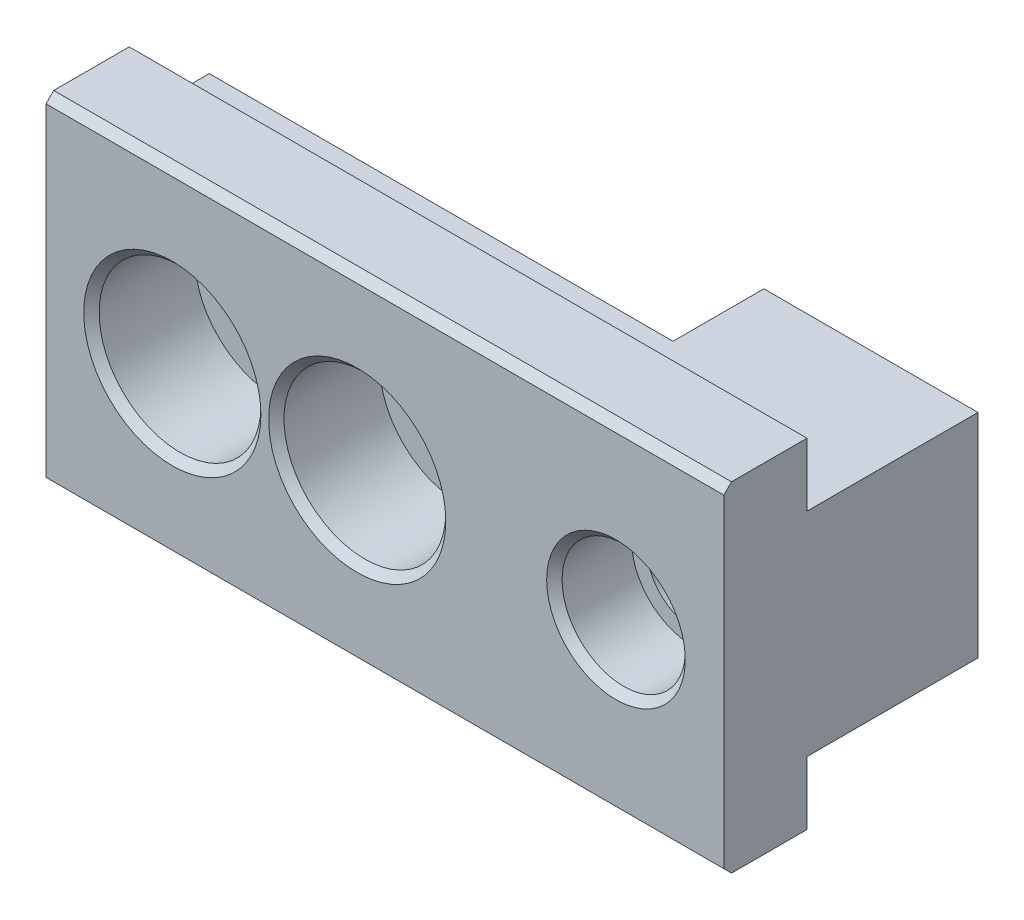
ISO-10303-21;
HEADER;
FILE_DESCRIPTION(('STEP AP214'),'2;1');
FILE_NAME('part.step','',(''),(''),'','','');
FILE_SCHEMA(('AUTOMOTIVE_DESIGN { 1 0 10303 214 1 1 1 1 }'));
ENDSEC;
DATA;
#1=APPLICATION_CONTEXT('core data for automotive mechanical design processes');
#2=APPLICATION_PROTOCOL_DEFINITION('international standard','automotive_design',2000,#1);
#3=PRODUCT_CONTEXT('',#1,'mechanical');
#4=PRODUCT('Part','Part','',(#3));
#5=PRODUCT_RELATED_PRODUCT_CATEGORY('part','',(#4));
#6=PRODUCT_DEFINITION_FORMATION('','',#4);
#7=PRODUCT_DEFINITION_CONTEXT('part definition',#1,'design');
#8=PRODUCT_DEFINITION('design','',#6,#7);
#9=PRODUCT_DEFINITION_SHAPE('','',#8);
#10=(LENGTH_UNIT() NAMED_UNIT(*) SI_UNIT(.MILLI.,.METRE.));
#11=(NAMED_UNIT(*) PLANE_ANGLE_UNIT() SI_UNIT($,.RADIAN.));
#12=(NAMED_UNIT(*) SI_UNIT($,.STERADIAN.) SOLID_ANGLE_UNIT());
#13=UNCERTAINTY_MEASURE_WITH_UNIT(LENGTH_MEASURE(1.E-05),#10,'distance_accuracy_value','');
#14=(GEOMETRIC_REPRESENTATION_CONTEXT(3) GLOBAL_UNCERTAINTY_ASSIGNED_CONTEXT((#13)) GLOBAL_UNIT_ASSIGNED_CONTEXT((#10,
#11,#12)) REPRESENTATION_CONTEXT('',''));
#15=CARTESIAN_POINT('',(0.,0.,0.));
#16=DIRECTION('',(0.,0.,1.));
#17=DIRECTION('',(1.,0.,0.));
#18=AXIS2_PLACEMENT_3D('',#15,#16,#17);
#19=CARTESIAN_POINT('',(-28.8,0.,5.4000000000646));
#20=DIRECTION('',(0.,0.,-1.));
#21=DIRECTION('',(0.,-1.,0.));
#22=AXIS2_PLACEMENT_3D('',#19,#20,#21);
#23=CYLINDRICAL_SURFACE('',#22,3.1);
#24=CARTESIAN_POINT('',(-28.8,0.,-4.7));
#25=DIRECTION('',(0.,0.,1.));
#26=DIRECTION('',(0.,1.,0.));
#27=AXIS2_PLACEMENT_3D('',#24,#25,#26);
#28=CIRCLE('',#27,3.1);
#29=CARTESIAN_POINT('',(-28.8,3.1,-4.70000000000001));
#30=VERTEX_POINT('',#29);
#31=EDGE_CURVE('E184',#30,#30,#28,.F.);
#32=ORIENTED_EDGE('',*,*,#31,.T.);
#33=EDGE_LOOP('',(#32));
#34=FACE_BOUND('',#33,.T.);
#35=CARTESIAN_POINT('',(-28.8,0.,-1.3));
#36=DIRECTION('',(0.,0.,1.));
#37=DIRECTION('',(1.,0.,0.));
#38=AXIS2_PLACEMENT_3D('',#35,#36,#37);
#39=CIRCLE('',#38,3.1);
#40=CARTESIAN_POINT('',(-25.7,0.,-1.3));
#41=VERTEX_POINT('',#40);
#42=EDGE_CURVE('E18',#41,#41,#39,.F.);
#43=ORIENTED_EDGE('',*,*,#42,.F.);
#44=EDGE_LOOP('',(#43));
#45=FACE_BOUND('',#44,.T.);
#46=ADVANCED_FACE('F14',(#34,#45),#23,.F.);
#47=CARTESIAN_POINT('',(-16.8,0.,5.4000000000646));
#48=DIRECTION('',(0.,0.,-1.));
#49=DIRECTION('',(0.,-1.,0.));
#50=AXIS2_PLACEMENT_3D('',#47,#48,#49);
#51=CYLINDRICAL_SURFACE('',#50,3.1);
#52=CARTESIAN_POINT('',(-16.8,0.,-4.7));
#53=DIRECTION('',(0.,0.,1.));
#54=DIRECTION('',(0.,1.,0.));
#55=AXIS2_PLACEMENT_3D('',#52,#53,#54);
#56=CIRCLE('',#55,3.1);
#57=CARTESIAN_POINT('',(-16.8,3.1,-4.70000000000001));
#58=VERTEX_POINT('',#57);
#59=EDGE_CURVE('E175',#58,#58,#56,.F.);
#60=ORIENTED_EDGE('',*,*,#59,.T.);
#61=EDGE_LOOP('',(#60));
#62=FACE_BOUND('',#61,.T.);
#63=CARTESIAN_POINT('',(-16.8,0.,-1.3));
#64=DIRECTION('',(0.,0.,1.));
#65=DIRECTION('',(1.,0.,0.));
#66=AXIS2_PLACEMENT_3D('',#63,#64,#65);
#67=CIRCLE('',#66,3.1);
#68=CARTESIAN_POINT('',(-13.7,0.,-1.3));
#69=VERTEX_POINT('',#68);
#70=EDGE_CURVE('E112',#69,#69,#67,.F.);
#71=ORIENTED_EDGE('',*,*,#70,.F.);
#72=EDGE_LOOP('',(#71));
#73=FACE_BOUND('',#72,.T.);
#74=ADVANCED_FACE('F284',(#62,#73),#51,.F.);
#75=CARTESIAN_POINT('',(0.,0.,0.4));
#76=DIRECTION('',(0.,0.,1.));
#77=DIRECTION('',(-1.,0.,0.));
#78=AXIS2_PLACEMENT_3D('',#75,#76,#77);
#79=PLANE('',#78);
#80=CARTESIAN_POINT('',(0.,0.,0.4));
#81=DIRECTION('',(0.,0.,1.));
#82=DIRECTION('',(-1.,0.,0.));
#83=AXIS2_PLACEMENT_3D('',#80,#81,#82);
#84=CIRCLE('',#83,3.);
#85=CARTESIAN_POINT('',(-3.,0.,0.4));
#86=VERTEX_POINT('',#85);
#87=EDGE_CURVE('E164',#86,#86,#84,.T.);
#88=ORIENTED_EDGE('',*,*,#87,.F.);
#89=EDGE_LOOP('',(#88));
#90=FACE_BOUND('',#89,.T.);
#91=CARTESIAN_POINT('',(0.,0.,0.4));
#92=DIRECTION('',(0.,0.,1.));
#93=DIRECTION('',(-1.,0.,0.));
#94=AXIS2_PLACEMENT_3D('',#91,#92,#93);
#95=CIRCLE('',#94,4.);
#96=CARTESIAN_POINT('',(-4.,0.,0.4));
#97=VERTEX_POINT('',#96);
#98=EDGE_CURVE('E154',#97,#97,#95,.T.);
#99=ORIENTED_EDGE('',*,*,#98,.T.);
#100=EDGE_LOOP('',(#99));
#101=FACE_BOUND('',#100,.T.);
#102=ADVANCED_FACE('F291',(#90,#101),#79,.T.);
#103=CARTESIAN_POINT('',(0.,0.,0.4));
#104=DIRECTION('',(0.,0.,1.));
#105=DIRECTION('',(-1.,0.,0.));
#106=AXIS2_PLACEMENT_3D('',#103,#104,#105);
#107=CYLINDRICAL_SURFACE('',#106,4.);
#108=CARTESIAN_POINT('',(0.,0.,4.90000000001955));
#109=DIRECTION('',(0.,0.,1.));
#110=DIRECTION('',(-1.,0.,0.));
#111=AXIS2_PLACEMENT_3D('',#108,#109,#110);
#112=CIRCLE('',#111,3.99999999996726);
#113=CARTESIAN_POINT('',(-3.99999999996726,0.,4.90000000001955));
#114=VERTEX_POINT('',#113);
#115=EDGE_CURVE('E140',#114,#114,#112,.T.);
#116=ORIENTED_EDGE('',*,*,#115,.T.);
#117=EDGE_LOOP('',(#116));
#118=FACE_BOUND('',#117,.T.);
#119=ORIENTED_EDGE('',*,*,#98,.F.);
#120=EDGE_LOOP('',(#119));
#121=FACE_BOUND('',#120,.T.);
#122=ADVANCED_FACE('F487',(#118,#121),#107,.F.);
#123=CARTESIAN_POINT('',(-7.,6.9,-11.1));
#124=DIRECTION('',(0.,0.,1.));
#125=DIRECTION('',(-1.,0.,0.));
#126=AXIS2_PLACEMENT_3D('',#123,#124,#125);
#127=PLANE('',#126);
#128=CARTESIAN_POINT('',(0.,0.,-11.1));
#129=DIRECTION('',(0.,0.,1.));
#130=DIRECTION('',(-1.,0.,0.));
#131=AXIS2_PLACEMENT_3D('',#128,#129,#130);
#132=CIRCLE('',#131,3.5);
#133=CARTESIAN_POINT('',(-3.5,0.,-11.1));
#134=VERTEX_POINT('',#133);
#135=EDGE_CURVE('E165',#134,#134,#132,.T.);
#136=ORIENTED_EDGE('',*,*,#135,.T.);
#137=EDGE_LOOP('',(#136));
#138=FACE_BOUND('',#137,.T.);
#139=DIRECTION('',(-1.,0.,0.));
#140=VECTOR('',#139,1.);
#141=CARTESIAN_POINT('',(-7.,-6.9,-11.1));
#142=LINE('',#141,#140);
#143=CARTESIAN_POINT('',(7.,-6.9,-11.1));
#144=VERTEX_POINT('',#143);
#145=CARTESIAN_POINT('',(-6.9,-6.9,-11.1));
#146=VERTEX_POINT('',#145);
#147=EDGE_CURVE('E145',#144,#146,#142,.T.);
#148=ORIENTED_EDGE('',*,*,#147,.T.);
#149=DIRECTION('',(0.,-1.,0.));
#150=VECTOR('',#149,1.);
#151=CARTESIAN_POINT('',(-6.9,16.5302528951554,-11.1));
#152=LINE('',#151,#150);
#153=CARTESIAN_POINT('',(-6.9,6.9,-11.1));
#154=VERTEX_POINT('',#153);
#155=EDGE_CURVE('E231',#154,#146,#152,.T.);
#156=ORIENTED_EDGE('',*,*,#155,.F.);
#157=DIRECTION('',(1.,0.,0.));
#158=VECTOR('',#157,1.);
#159=CARTESIAN_POINT('',(-7.,6.9,-11.1));
#160=LINE('',#159,#158);
#161=CARTESIAN_POINT('',(7.,6.9,-11.1));
#162=VERTEX_POINT('',#161);
#163=EDGE_CURVE('E150',#154,#162,#160,.T.);
#164=ORIENTED_EDGE('',*,*,#163,.T.);
#165=DIRECTION('',(0.,1.,0.));
#166=VECTOR('',#165,1.);
#167=CARTESIAN_POINT('',(7.,6.9,-11.1));
#168=LINE('',#167,#166);
#169=EDGE_CURVE('E130',#144,#162,#168,.T.);
#170=ORIENTED_EDGE('',*,*,#169,.F.);
#171=EDGE_LOOP('',(#148,#156,#164,#170));
#172=FACE_BOUND('',#171,.T.);
#173=ADVANCED_FACE('F269',(#138,#172),#127,.F.);
#174=CARTESIAN_POINT('',(-7.,12.3,0.));
#175=DIRECTION('',(0.,0.,1.));
#176=DIRECTION('',(-1.,0.,0.));
#177=AXIS2_PLACEMENT_3D('',#174,#175,#176);
#178=PLANE('',#177);
#179=DIRECTION('',(0.,-1.,0.));
#180=VECTOR('',#179,1.);
#181=CARTESIAN_POINT('',(-37.,6.9,0.));
#182=LINE('',#181,#180);
#183=CARTESIAN_POINT('',(-37.,11.,0.));
#184=VERTEX_POINT('',#183);
#185=CARTESIAN_POINT('',(-37.,6.9,0.));
#186=VERTEX_POINT('',#185);
#187=EDGE_CURVE('E119',#184,#186,#182,.T.);
#188=ORIENTED_EDGE('',*,*,#187,.F.);
#189=DIRECTION('',(1.,0.,0.));
#190=VECTOR('',#189,1.);
#191=CARTESIAN_POINT('',(-7.,11.,0.));
#192=LINE('',#191,#190);
#193=CARTESIAN_POINT('',(7.,11.,0.));
#194=VERTEX_POINT('',#193);
#195=EDGE_CURVE('E107',#184,#194,#192,.T.);
#196=ORIENTED_EDGE('',*,*,#195,.T.);
#197=DIRECTION('',(0.,1.,0.));
#198=VECTOR('',#197,1.);
#199=CARTESIAN_POINT('',(7.,6.9,0.));
#200=LINE('',#199,#198);
#201=CARTESIAN_POINT('',(7.,6.9,0.));
#202=VERTEX_POINT('',#201);
#203=EDGE_CURVE('E118',#202,#194,#200,.T.);
#204=ORIENTED_EDGE('',*,*,#203,.F.);
#205=DIRECTION('',(1.,0.,0.));
#206=VECTOR('',#205,1.);
#207=CARTESIAN_POINT('',(-7.,6.9,0.));
#208=LINE('',#207,#206);
#209=EDGE_CURVE('E152',#202,#186,#208,.F.);
#210=ORIENTED_EDGE('',*,*,#209,.T.);
#211=EDGE_LOOP('',(#188,#196,#204,#210));
#212=FACE_BOUND('',#211,.T.);
#213=ADVANCED_FACE('F116',(#212),#178,.F.);
#214=CARTESIAN_POINT('',(-7.,6.9,-11.1));
#215=DIRECTION('',(0.,-1.,0.));
#216=DIRECTION('',(1.,0.,0.));
#217=AXIS2_PLACEMENT_3D('',#214,#215,#216);
#218=PLANE('',#217);
#219=DIRECTION('',(0.,0.,1.));
#220=VECTOR('',#219,1.);
#221=CARTESIAN_POINT('',(-6.9,6.9,-11.1));
#222=LINE('',#221,#220);
#223=CARTESIAN_POINT('',(-6.9,6.9,-5.2));
#224=VERTEX_POINT('',#223);
#225=EDGE_CURVE('E236',#154,#224,#222,.T.);
#226=ORIENTED_EDGE('',*,*,#225,.T.);
#227=DIRECTION('',(-1.,0.,0.));
#228=VECTOR('',#227,1.);
#229=CARTESIAN_POINT('',(-37.,6.9,-5.2));
#230=LINE('',#229,#228);
#231=CARTESIAN_POINT('',(-37.,6.9,-5.2));
#232=VERTEX_POINT('',#231);
#233=EDGE_CURVE('E148',#224,#232,#230,.T.);
#234=ORIENTED_EDGE('',*,*,#233,.T.);
#235=DIRECTION('',(0.,0.,1.));
#236=VECTOR('',#235,1.);
#237=CARTESIAN_POINT('',(-37.,6.9,-11.1));
#238=LINE('',#237,#236);
#239=EDGE_CURVE('E128',#186,#232,#238,.F.);
#240=ORIENTED_EDGE('',*,*,#239,.F.);
#241=ORIENTED_EDGE('',*,*,#209,.F.);
#242=DIRECTION('',(0.,0.,1.));
#243=VECTOR('',#242,1.);
#244=CARTESIAN_POINT('',(7.,6.9,-11.1));
#245=LINE('',#244,#243);
#246=EDGE_CURVE('E126',#162,#202,#245,.T.);
#247=ORIENTED_EDGE('',*,*,#246,.F.);
#248=ORIENTED_EDGE('',*,*,#163,.F.);
#249=EDGE_LOOP('',(#226,#234,#240,#241,#247,#248));
#250=FACE_BOUND('',#249,.T.);
#251=ADVANCED_FACE('F271',(#250),#218,.F.);
#252=CARTESIAN_POINT('',(-37.,-6.9,-5.2));
#253=DIRECTION('',(0.,0.,1.));
#254=DIRECTION('',(0.,1.,0.));
#255=AXIS2_PLACEMENT_3D('',#252,#253,#254);
#256=PLANE('',#255);
#257=CARTESIAN_POINT('',(-16.8,0.,-5.2));
#258=DIRECTION('',(0.,0.,1.));
#259=DIRECTION('',(0.,1.,0.));
#260=AXIS2_PLACEMENT_3D('',#257,#258,#259);
#261=CIRCLE('',#260,3.6);
#262=CARTESIAN_POINT('',(-16.8,3.6,-5.2));
#263=VERTEX_POINT('',#262);
#264=EDGE_CURVE('E181',#263,#263,#261,.T.);
#265=ORIENTED_EDGE('',*,*,#264,.T.);
#266=EDGE_LOOP('',(#265));
#267=FACE_BOUND('',#266,.T.);
#268=CARTESIAN_POINT('',(-28.8,0.,-5.2));
#269=DIRECTION('',(0.,0.,1.));
#270=DIRECTION('',(0.,1.,0.));
#271=AXIS2_PLACEMENT_3D('',#268,#269,#270);
#272=CIRCLE('',#271,3.6);
#273=CARTESIAN_POINT('',(-28.8,3.6,-5.2));
#274=VERTEX_POINT('',#273);
#275=EDGE_CURVE('E178',#274,#274,#272,.T.);
#276=ORIENTED_EDGE('',*,*,#275,.T.);
#277=EDGE_LOOP('',(#276));
#278=FACE_BOUND('',#277,.T.);
#279=DIRECTION('',(0.,-1.,0.));
#280=VECTOR('',#279,1.);
#281=CARTESIAN_POINT('',(-37.,6.9,-5.2));
#282=LINE('',#281,#280);
#283=CARTESIAN_POINT('',(-37.,-6.9,-5.2));
#284=VERTEX_POINT('',#283);
#285=EDGE_CURVE('E249',#232,#284,#282,.T.);
#286=ORIENTED_EDGE('',*,*,#285,.F.);
#287=ORIENTED_EDGE('',*,*,#233,.F.);
#288=DIRECTION('',(0.,-1.,0.));
#289=VECTOR('',#288,1.);
#290=CARTESIAN_POINT('',(-6.9,16.5302528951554,-5.2));
#291=LINE('',#290,#289);
#292=CARTESIAN_POINT('',(-6.9,-6.9,-5.2));
#293=VERTEX_POINT('',#292);
#294=EDGE_CURVE('E233',#224,#293,#291,.T.);
#295=ORIENTED_EDGE('',*,*,#294,.T.);
#296=DIRECTION('',(-1.,0.,0.));
#297=VECTOR('',#296,1.);
#298=CARTESIAN_POINT('',(-7.,-6.9,-5.2));
#299=LINE('',#298,#297);
#300=EDGE_CURVE('E143',#293,#284,#299,.T.);
#301=ORIENTED_EDGE('',*,*,#300,.T.);
#302=EDGE_LOOP('',(#286,#287,#295,#301));
#303=FACE_BOUND('',#302,.T.);
#304=ADVANCED_FACE('F259',(#267,#278,#303),#256,.F.);
#305=CARTESIAN_POINT('',(-7.,-6.9,-11.1));
#306=DIRECTION('',(0.,1.,0.));
#307=DIRECTION('',(-1.,0.,0.));
#308=AXIS2_PLACEMENT_3D('',#305,#306,#307);
#309=PLANE('',#308);
#310=ORIENTED_EDGE('',*,*,#300,.F.);
#311=DIRECTION('',(0.,0.,-1.));
#312=VECTOR('',#311,1.);
#313=CARTESIAN_POINT('',(-6.9,-6.9,-11.1));
#314=LINE('',#313,#312);
#315=EDGE_CURVE('E172',#293,#146,#314,.T.);
#316=ORIENTED_EDGE('',*,*,#315,.T.);
#317=ORIENTED_EDGE('',*,*,#147,.F.);
#318=DIRECTION('',(0.,0.,1.));
#319=VECTOR('',#318,1.);
#320=CARTESIAN_POINT('',(7.,-6.9,-11.1));
#321=LINE('',#320,#319);
#322=CARTESIAN_POINT('',(7.,-6.9,0.));
#323=VERTEX_POINT('',#322);
#324=EDGE_CURVE('E135',#323,#144,#321,.F.);
#325=ORIENTED_EDGE('',*,*,#324,.F.);
#326=DIRECTION('',(-1.,0.,0.));
#327=VECTOR('',#326,1.);
#328=CARTESIAN_POINT('',(-7.,-6.9,0.));
#329=LINE('',#328,#327);
#330=CARTESIAN_POINT('',(-37.,-6.9,0.));
#331=VERTEX_POINT('',#330);
#332=EDGE_CURVE('E141',#323,#331,#329,.T.);
#333=ORIENTED_EDGE('',*,*,#332,.T.);
#334=DIRECTION('',(0.,0.,1.));
#335=VECTOR('',#334,1.);
#336=CARTESIAN_POINT('',(-37.,-6.9,-11.1));
#337=LINE('',#336,#335);
#338=EDGE_CURVE('E246',#284,#331,#337,.T.);
#339=ORIENTED_EDGE('',*,*,#338,.F.);
#340=EDGE_LOOP('',(#310,#316,#317,#325,#333,#339));
#341=FACE_BOUND('',#340,.T.);
#342=ADVANCED_FACE('F263',(#341),#309,.F.);
#343=CARTESIAN_POINT('',(-7.,-6.9,0.));
#344=DIRECTION('',(0.,0.,1.));
#345=DIRECTION('',(-1.,0.,0.));
#346=AXIS2_PLACEMENT_3D('',#343,#344,#345);
#347=PLANE('',#346);
#348=DIRECTION('',(0.,1.,0.));
#349=VECTOR('',#348,1.);
#350=CARTESIAN_POINT('',(7.,6.9,0.));
#351=LINE('',#350,#349);
#352=CARTESIAN_POINT('',(7.,-11.,0.));
#353=VERTEX_POINT('',#352);
#354=EDGE_CURVE('E138',#353,#323,#351,.T.);
#355=ORIENTED_EDGE('',*,*,#354,.F.);
#356=DIRECTION('',(-1.,0.,0.));
#357=VECTOR('',#356,1.);
#358=CARTESIAN_POINT('',(-7.,-11.,0.));
#359=LINE('',#358,#357);
#360=CARTESIAN_POINT('',(-37.,-11.,0.));
#361=VERTEX_POINT('',#360);
#362=EDGE_CURVE('E227',#353,#361,#359,.T.);
#363=ORIENTED_EDGE('',*,*,#362,.T.);
#364=DIRECTION('',(0.,-1.,0.));
#365=VECTOR('',#364,1.);
#366=CARTESIAN_POINT('',(-37.,6.9,0.));
#367=LINE('',#366,#365);
#368=EDGE_CURVE('E161',#331,#361,#367,.T.);
#369=ORIENTED_EDGE('',*,*,#368,.F.);
#370=ORIENTED_EDGE('',*,*,#332,.F.);
#371=EDGE_LOOP('',(#355,#363,#369,#370));
#372=FACE_BOUND('',#371,.T.);
#373=ADVANCED_FACE('F316',(#372),#347,.F.);
#374=CARTESIAN_POINT('',(0.,0.,5.4000000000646));
#375=DIRECTION('',(0.,0.,1.));
#376=DIRECTION('',(-1.,0.,0.));
#377=AXIS2_PLACEMENT_3D('',#374,#375,#376);
#378=CONICAL_SURFACE('',#377,4.49999999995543,0.785398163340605);
#379=CARTESIAN_POINT('',(0.,0.,5.4000000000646));
#380=DIRECTION('',(0.,0.,1.));
#381=DIRECTION('',(-1.,0.,0.));
#382=AXIS2_PLACEMENT_3D('',#379,#380,#381);
#383=CIRCLE('',#382,4.49999999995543);
#384=CARTESIAN_POINT('',(-4.49999999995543,0.,5.4000000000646));
#385=VERTEX_POINT('',#384);
#386=EDGE_CURVE('E157',#385,#385,#383,.T.);
#387=ORIENTED_EDGE('',*,*,#386,.T.);
#388=EDGE_LOOP('',(#387));
#389=FACE_BOUND('',#388,.T.);
#390=ORIENTED_EDGE('',*,*,#115,.F.);
#391=EDGE_LOOP('',(#390));
#392=FACE_BOUND('',#391,.T.);
#393=ADVANCED_FACE('F313',(#389,#392),#378,.F.);
#394=CARTESIAN_POINT('',(7.,6.9,-11.1));
#395=DIRECTION('',(1.,0.,0.));
#396=DIRECTION('',(0.,1.,0.));
#397=AXIS2_PLACEMENT_3D('',#394,#395,#396);
#398=PLANE('',#397);
#399=DIRECTION('',(0.,0.,-1.));
#400=VECTOR('',#399,1.);
#401=CARTESIAN_POINT('',(7.,11.,6.51132535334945));
#402=LINE('',#401,#400);
#403=CARTESIAN_POINT('',(7.,11.,4.9));
#404=VERTEX_POINT('',#403);
#405=EDGE_CURVE('E104',#404,#194,#402,.T.);
#406=ORIENTED_EDGE('',*,*,#405,.F.);
#407=DIRECTION('',(0.,0.707106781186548,-0.707106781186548));
#408=VECTOR('',#407,1.);
#409=CARTESIAN_POINT('',(7.,16.95,-1.05));
#410=LINE('',#409,#408);
#411=CARTESIAN_POINT('',(7.,10.5,5.4));
#412=VERTEX_POINT('',#411);
#413=EDGE_CURVE('E23',#404,#412,#410,.F.);
#414=ORIENTED_EDGE('',*,*,#413,.T.);
#415=DIRECTION('',(0.,-1.,0.));
#416=VECTOR('',#415,1.);
#417=CARTESIAN_POINT('',(7.,12.3,5.4));
#418=LINE('',#417,#416);
#419=CARTESIAN_POINT('',(7.,-10.5,5.4));
#420=VERTEX_POINT('',#419);
#421=EDGE_CURVE('E160',#412,#420,#418,.T.);
#422=ORIENTED_EDGE('',*,*,#421,.T.);
#423=DIRECTION('',(0.,0.707106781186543,0.707106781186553));
#424=VECTOR('',#423,1.);
#425=CARTESIAN_POINT('',(7.,-10.0500000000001,5.84999999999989));
#426=LINE('',#425,#424);
#427=CARTESIAN_POINT('',(7.,-11.,4.9));
#428=VERTEX_POINT('',#427);
#429=EDGE_CURVE('E31',#420,#428,#426,.F.);
#430=ORIENTED_EDGE('',*,*,#429,.T.);
#431=DIRECTION('',(0.,0.,1.));
#432=VECTOR('',#431,1.);
#433=CARTESIAN_POINT('',(7.,-11.,6.51132535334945));
#434=LINE('',#433,#432);
#435=EDGE_CURVE('E120',#353,#428,#434,.T.);
#436=ORIENTED_EDGE('',*,*,#435,.F.);
#437=ORIENTED_EDGE('',*,*,#354,.T.);
#438=ORIENTED_EDGE('',*,*,#324,.T.);
#439=ORIENTED_EDGE('',*,*,#169,.T.);
#440=ORIENTED_EDGE('',*,*,#246,.T.);
#441=ORIENTED_EDGE('',*,*,#203,.T.);
#442=EDGE_LOOP('',(#406,#414,#422,#430,#436,#437,#438,#439,#440,#441));
#443=FACE_BOUND('',#442,.T.);
#444=ADVANCED_FACE('F123',(#443),#398,.T.);
#445=CARTESIAN_POINT('',(-37.,6.9,-11.1));
#446=DIRECTION('',(-1.,0.,0.));
#447=DIRECTION('',(0.,-1.,0.));
#448=AXIS2_PLACEMENT_3D('',#445,#446,#447);
#449=PLANE('',#448);
#450=DIRECTION('',(0.,-1.,0.));
#451=VECTOR('',#450,1.);
#452=CARTESIAN_POINT('',(-37.,12.3,5.4));
#453=LINE('',#452,#451);
#454=CARTESIAN_POINT('',(-37.,-10.5,5.4));
#455=VERTEX_POINT('',#454);
#456=CARTESIAN_POINT('',(-37.,10.5,5.4));
#457=VERTEX_POINT('',#456);
#458=EDGE_CURVE('E169',#455,#457,#453,.F.);
#459=ORIENTED_EDGE('',*,*,#458,.T.);
#460=DIRECTION('',(0.,-0.707106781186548,0.707106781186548));
#461=VECTOR('',#460,1.);
#462=CARTESIAN_POINT('',(-37.,16.95,-1.05));
#463=LINE('',#462,#461);
#464=CARTESIAN_POINT('',(-37.,11.,4.9));
#465=VERTEX_POINT('',#464);
#466=EDGE_CURVE('E207',#457,#465,#463,.F.);
#467=ORIENTED_EDGE('',*,*,#466,.T.);
#468=DIRECTION('',(0.,0.,-1.));
#469=VECTOR('',#468,1.);
#470=CARTESIAN_POINT('',(-37.,11.,6.51132535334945));
#471=LINE('',#470,#469);
#472=EDGE_CURVE('E111',#465,#184,#471,.T.);
#473=ORIENTED_EDGE('',*,*,#472,.T.);
#474=ORIENTED_EDGE('',*,*,#187,.T.);
#475=ORIENTED_EDGE('',*,*,#239,.T.);
#476=ORIENTED_EDGE('',*,*,#285,.T.);
#477=ORIENTED_EDGE('',*,*,#338,.T.);
#478=ORIENTED_EDGE('',*,*,#368,.T.);
#479=DIRECTION('',(0.,0.,1.));
#480=VECTOR('',#479,1.);
#481=CARTESIAN_POINT('',(-37.,-11.,6.51132535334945));
#482=LINE('',#481,#480);
#483=CARTESIAN_POINT('',(-37.,-11.,4.9));
#484=VERTEX_POINT('',#483);
#485=EDGE_CURVE('E224',#361,#484,#482,.T.);
#486=ORIENTED_EDGE('',*,*,#485,.T.);
#487=DIRECTION('',(0.,-0.707106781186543,-0.707106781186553));
#488=VECTOR('',#487,1.);
#489=CARTESIAN_POINT('',(-37.,-10.0500000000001,5.84999999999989));
#490=LINE('',#489,#488);
#491=EDGE_CURVE('E205',#484,#455,#490,.F.);
#492=ORIENTED_EDGE('',*,*,#491,.T.);
#493=EDGE_LOOP('',(#459,#467,#473,#474,#475,#476,#477,#478,#486,#492));
#494=FACE_BOUND('',#493,.T.);
#495=ADVANCED_FACE('F255',(#494),#449,.T.);
#496=CARTESIAN_POINT('',(-7.,12.3,5.4));
#497=DIRECTION('',(0.,0.,-1.));
#498=DIRECTION('',(1.,0.,0.));
#499=AXIS2_PLACEMENT_3D('',#496,#497,#498);
#500=PLANE('',#499);
#501=CARTESIAN_POINT('',(-16.8,0.,5.4));
#502=DIRECTION('',(0.,0.,-1.));
#503=DIRECTION('',(1.,0.,0.));
#504=AXIS2_PLACEMENT_3D('',#501,#502,#503);
#505=CIRCLE('',#504,5.75);
#506=CARTESIAN_POINT('',(-11.05,0.,5.4));
#507=VERTEX_POINT('',#506);
#508=EDGE_CURVE('E193',#507,#507,#505,.T.);
#509=ORIENTED_EDGE('',*,*,#508,.T.);
#510=EDGE_LOOP('',(#509));
#511=FACE_BOUND('',#510,.T.);
#512=CARTESIAN_POINT('',(-28.8,0.,5.4));
#513=DIRECTION('',(0.,0.,-1.));
#514=DIRECTION('',(1.,0.,0.));
#515=AXIS2_PLACEMENT_3D('',#512,#513,#514);
#516=CIRCLE('',#515,5.75);
#517=CARTESIAN_POINT('',(-23.05,0.,5.4));
#518=VERTEX_POINT('',#517);
#519=EDGE_CURVE('E190',#518,#518,#516,.T.);
#520=ORIENTED_EDGE('',*,*,#519,.T.);
#521=EDGE_LOOP('',(#520));
#522=FACE_BOUND('',#521,.T.);
#523=ORIENTED_EDGE('',*,*,#421,.F.);
#524=DIRECTION('',(-1.,0.,0.));
#525=VECTOR('',#524,1.);
#526=CARTESIAN_POINT('',(-7.,10.5,5.4));
#527=LINE('',#526,#525);
#528=EDGE_CURVE('E202',#412,#457,#527,.T.);
#529=ORIENTED_EDGE('',*,*,#528,.T.);
#530=ORIENTED_EDGE('',*,*,#458,.F.);
#531=DIRECTION('',(1.,0.,0.));
#532=VECTOR('',#531,1.);
#533=CARTESIAN_POINT('',(-7.,-10.5,5.4));
#534=LINE('',#533,#532);
#535=EDGE_CURVE('E199',#455,#420,#534,.T.);
#536=ORIENTED_EDGE('',*,*,#535,.T.);
#537=EDGE_LOOP('',(#523,#529,#530,#536));
#538=FACE_BOUND('',#537,.T.);
#539=ORIENTED_EDGE('',*,*,#386,.F.);
#540=EDGE_LOOP('',(#539));
#541=FACE_BOUND('',#540,.T.);
#542=ADVANCED_FACE('F294',(#511,#522,#538,#541),#500,.F.);
#543=CARTESIAN_POINT('',(0.,0.,-11.1));
#544=DIRECTION('',(0.,0.,1.));
#545=DIRECTION('',(-1.,0.,0.));
#546=AXIS2_PLACEMENT_3D('',#543,#544,#545);
#547=CYLINDRICAL_SURFACE('',#546,3.);
#548=CARTESIAN_POINT('',(0.,0.,-10.6));
#549=DIRECTION('',(0.,0.,1.));
#550=DIRECTION('',(-1.,0.,0.));
#551=AXIS2_PLACEMENT_3D('',#548,#549,#550);
#552=CIRCLE('',#551,3.);
#553=CARTESIAN_POINT('',(-3.,0.,-10.6));
#554=VERTEX_POINT('',#553);
#555=EDGE_CURVE('E168',#554,#554,#552,.F.);
#556=ORIENTED_EDGE('',*,*,#555,.T.);
#557=EDGE_LOOP('',(#556));
#558=FACE_BOUND('',#557,.T.);
#559=ORIENTED_EDGE('',*,*,#87,.T.);
#560=EDGE_LOOP('',(#559));
#561=FACE_BOUND('',#560,.T.);
#562=ADVANCED_FACE('F302',(#558,#561),#547,.F.);
#563=CARTESIAN_POINT('',(0.,0.,-11.1));
#564=DIRECTION('',(0.,0.,-1.));
#565=DIRECTION('',(1.,0.,0.));
#566=AXIS2_PLACEMENT_3D('',#563,#564,#565);
#567=CONICAL_SURFACE('',#566,3.5,0.785398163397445);
#568=ORIENTED_EDGE('',*,*,#555,.F.);
#569=EDGE_LOOP('',(#568));
#570=FACE_BOUND('',#569,.T.);
#571=ORIENTED_EDGE('',*,*,#135,.F.);
#572=EDGE_LOOP('',(#571));
#573=FACE_BOUND('',#572,.T.);
#574=ADVANCED_FACE('F301',(#570,#573),#567,.F.);
#575=CARTESIAN_POINT('',(-6.9,16.5302528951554,27.8555281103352));
#576=DIRECTION('',(1.,0.,0.));
#577=DIRECTION('',(0.,1.,0.));
#578=AXIS2_PLACEMENT_3D('',#575,#576,#577);
#579=PLANE('',#578);
#580=ORIENTED_EDGE('',*,*,#155,.T.);
#581=ORIENTED_EDGE('',*,*,#315,.F.);
#582=ORIENTED_EDGE('',*,*,#294,.F.);
#583=ORIENTED_EDGE('',*,*,#225,.F.);
#584=EDGE_LOOP('',(#580,#581,#582,#583));
#585=FACE_BOUND('',#584,.T.);
#586=ADVANCED_FACE('F265',(#585),#579,.F.);
#587=CARTESIAN_POINT('',(-28.8,0.,0.4));
#588=DIRECTION('',(0.,0.,1.));
#589=DIRECTION('',(-1.,0.,0.));
#590=AXIS2_PLACEMENT_3D('',#587,#588,#589);
#591=CYLINDRICAL_SURFACE('',#590,5.25);
#592=CARTESIAN_POINT('',(-28.8,0.,4.9));
#593=DIRECTION('',(0.,0.,-1.));
#594=DIRECTION('',(1.,0.,0.));
#595=AXIS2_PLACEMENT_3D('',#592,#593,#594);
#596=CIRCLE('',#595,5.25);
#597=CARTESIAN_POINT('',(-23.55,0.,4.9));
#598=VERTEX_POINT('',#597);
#599=EDGE_CURVE('E196',#598,#598,#596,.F.);
#600=ORIENTED_EDGE('',*,*,#599,.T.);
#601=EDGE_LOOP('',(#600));
#602=FACE_BOUND('',#601,.T.);
#603=CARTESIAN_POINT('',(-28.8,0.,-1.3));
#604=DIRECTION('',(0.,0.,1.));
#605=DIRECTION('',(1.,0.,0.));
#606=AXIS2_PLACEMENT_3D('',#603,#604,#605);
#607=CIRCLE('',#606,5.25);
#608=CARTESIAN_POINT('',(-23.55,0.,-1.3));
#609=VERTEX_POINT('',#608);
#610=EDGE_CURVE('E220',#609,#609,#607,.T.);
#611=ORIENTED_EDGE('',*,*,#610,.F.);
#612=EDGE_LOOP('',(#611));
#613=FACE_BOUND('',#612,.T.);
#614=ADVANCED_FACE('F300',(#602,#613),#591,.F.);
#615=CARTESIAN_POINT('',(-16.8,0.,0.4));
#616=DIRECTION('',(0.,0.,1.));
#617=DIRECTION('',(-1.,0.,0.));
#618=AXIS2_PLACEMENT_3D('',#615,#616,#617);
#619=CYLINDRICAL_SURFACE('',#618,5.25);
#620=CARTESIAN_POINT('',(-16.8,0.,4.9));
#621=DIRECTION('',(0.,0.,-1.));
#622=DIRECTION('',(1.,0.,0.));
#623=AXIS2_PLACEMENT_3D('',#620,#621,#622);
#624=CIRCLE('',#623,5.25);
#625=CARTESIAN_POINT('',(-11.55,0.,4.9));
#626=VERTEX_POINT('',#625);
#627=EDGE_CURVE('E187',#626,#626,#624,.F.);
#628=ORIENTED_EDGE('',*,*,#627,.T.);
#629=EDGE_LOOP('',(#628));
#630=FACE_BOUND('',#629,.T.);
#631=CARTESIAN_POINT('',(-16.8,0.,-1.3));
#632=DIRECTION('',(0.,0.,1.));
#633=DIRECTION('',(1.,0.,0.));
#634=AXIS2_PLACEMENT_3D('',#631,#632,#633);
#635=CIRCLE('',#634,5.25);
#636=CARTESIAN_POINT('',(-11.55,0.,-1.3));
#637=VERTEX_POINT('',#636);
#638=EDGE_CURVE('E212',#637,#637,#635,.T.);
#639=ORIENTED_EDGE('',*,*,#638,.F.);
#640=EDGE_LOOP('',(#639));
#641=FACE_BOUND('',#640,.T.);
#642=ADVANCED_FACE('F381',(#630,#641),#619,.F.);
#643=CARTESIAN_POINT('',(-16.8,0.,-4.7));
#644=DIRECTION('',(0.,0.,-1.));
#645=DIRECTION('',(0.,-1.,0.));
#646=AXIS2_PLACEMENT_3D('',#643,#644,#645);
#647=CONICAL_SURFACE('',#646,3.1,0.785398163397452);
#648=ORIENTED_EDGE('',*,*,#264,.F.);
#649=EDGE_LOOP('',(#648));
#650=FACE_BOUND('',#649,.T.);
#651=ORIENTED_EDGE('',*,*,#59,.F.);
#652=EDGE_LOOP('',(#651));
#653=FACE_BOUND('',#652,.T.);
#654=ADVANCED_FACE('F389',(#650,#653),#647,.F.);
#655=CARTESIAN_POINT('',(-28.8,0.,-4.7));
#656=DIRECTION('',(0.,0.,-1.));
#657=DIRECTION('',(0.,-1.,0.));
#658=AXIS2_PLACEMENT_3D('',#655,#656,#657);
#659=CONICAL_SURFACE('',#658,3.1,0.785398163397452);
#660=ORIENTED_EDGE('',*,*,#275,.F.);
#661=EDGE_LOOP('',(#660));
#662=FACE_BOUND('',#661,.T.);
#663=ORIENTED_EDGE('',*,*,#31,.F.);
#664=EDGE_LOOP('',(#663));
#665=FACE_BOUND('',#664,.T.);
#666=ADVANCED_FACE('F398',(#662,#665),#659,.F.);
#667=CARTESIAN_POINT('',(-16.8,0.,4.9));
#668=DIRECTION('',(0.,0.,1.));
#669=DIRECTION('',(-1.,0.,0.));
#670=AXIS2_PLACEMENT_3D('',#667,#668,#669);
#671=CONICAL_SURFACE('',#670,5.25,0.785398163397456);
#672=ORIENTED_EDGE('',*,*,#508,.F.);
#673=EDGE_LOOP('',(#672));
#674=FACE_BOUND('',#673,.T.);
#675=ORIENTED_EDGE('',*,*,#627,.F.);
#676=EDGE_LOOP('',(#675));
#677=FACE_BOUND('',#676,.T.);
#678=ADVANCED_FACE('F407',(#674,#677),#671,.F.);
#679=CARTESIAN_POINT('',(-28.8,0.,4.9));
#680=DIRECTION('',(0.,0.,1.));
#681=DIRECTION('',(-1.,0.,0.));
#682=AXIS2_PLACEMENT_3D('',#679,#680,#681);
#683=CONICAL_SURFACE('',#682,5.25,0.785398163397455);
#684=ORIENTED_EDGE('',*,*,#519,.F.);
#685=EDGE_LOOP('',(#684));
#686=FACE_BOUND('',#685,.T.);
#687=ORIENTED_EDGE('',*,*,#599,.F.);
#688=EDGE_LOOP('',(#687));
#689=FACE_BOUND('',#688,.T.);
#690=ADVANCED_FACE('F416',(#686,#689),#683,.F.);
#691=CARTESIAN_POINT('',(-37.,-11.,6.51132535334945));
#692=DIRECTION('',(0.,1.,0.));
#693=DIRECTION('',(-1.,0.,0.));
#694=AXIS2_PLACEMENT_3D('',#691,#692,#693);
#695=PLANE('',#694);
#696=ORIENTED_EDGE('',*,*,#435,.T.);
#697=DIRECTION('',(-1.,0.,0.));
#698=VECTOR('',#697,1.);
#699=CARTESIAN_POINT('',(-37.,-11.,4.9));
#700=LINE('',#699,#698);
#701=EDGE_CURVE('E9',#428,#484,#700,.T.);
#702=ORIENTED_EDGE('',*,*,#701,.T.);
#703=ORIENTED_EDGE('',*,*,#485,.F.);
#704=ORIENTED_EDGE('',*,*,#362,.F.);
#705=EDGE_LOOP('',(#696,#702,#703,#704));
#706=FACE_BOUND('',#705,.T.);
#707=ADVANCED_FACE('F425',(#706),#695,.F.);
#708=CARTESIAN_POINT('',(-37.,11.,6.51132535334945));
#709=DIRECTION('',(0.,-1.,0.));
#710=DIRECTION('',(0.,0.,1.));
#711=AXIS2_PLACEMENT_3D('',#708,#709,#710);
#712=PLANE('',#711);
#713=ORIENTED_EDGE('',*,*,#472,.F.);
#714=DIRECTION('',(1.,0.,0.));
#715=VECTOR('',#714,1.);
#716=CARTESIAN_POINT('',(-37.,11.,4.9));
#717=LINE('',#716,#715);
#718=EDGE_CURVE('E39',#465,#404,#717,.T.);
#719=ORIENTED_EDGE('',*,*,#718,.T.);
#720=ORIENTED_EDGE('',*,*,#405,.T.);
#721=ORIENTED_EDGE('',*,*,#195,.F.);
#722=EDGE_LOOP('',(#713,#719,#720,#721));
#723=FACE_BOUND('',#722,.T.);
#724=ADVANCED_FACE('F106',(#723),#712,.F.);
#725=CARTESIAN_POINT('',(-7.,10.5,5.4));
#726=DIRECTION('',(0.,-0.707106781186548,-0.707106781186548));
#727=DIRECTION('',(-1.,0.,0.));
#728=AXIS2_PLACEMENT_3D('',#725,#726,#727);
#729=PLANE('',#728);
#730=ORIENTED_EDGE('',*,*,#413,.F.);
#731=ORIENTED_EDGE('',*,*,#718,.F.);
#732=ORIENTED_EDGE('',*,*,#466,.F.);
#733=ORIENTED_EDGE('',*,*,#528,.F.);
#734=EDGE_LOOP('',(#730,#731,#732,#733));
#735=FACE_BOUND('',#734,.T.);
#736=ADVANCED_FACE('F442',(#735),#729,.F.);
#737=CARTESIAN_POINT('',(-7.,-10.5,5.4));
#738=DIRECTION('',(0.,0.707106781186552,-0.707106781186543));
#739=DIRECTION('',(1.,0.,0.));
#740=AXIS2_PLACEMENT_3D('',#737,#738,#739);
#741=PLANE('',#740);
#742=ORIENTED_EDGE('',*,*,#491,.F.);
#743=ORIENTED_EDGE('',*,*,#701,.F.);
#744=ORIENTED_EDGE('',*,*,#429,.F.);
#745=ORIENTED_EDGE('',*,*,#535,.F.);
#746=EDGE_LOOP('',(#742,#743,#744,#745));
#747=FACE_BOUND('',#746,.T.);
#748=ADVANCED_FACE('F16',(#747),#741,.F.);
#749=CARTESIAN_POINT('',(-16.8,0.,-1.3));
#750=DIRECTION('',(0.,0.,1.));
#751=DIRECTION('',(1.,0.,0.));
#752=AXIS2_PLACEMENT_3D('',#749,#750,#751);
#753=PLANE('',#752);
#754=ORIENTED_EDGE('',*,*,#638,.T.);
#755=EDGE_LOOP('',(#754));
#756=FACE_BOUND('',#755,.T.);
#757=ORIENTED_EDGE('',*,*,#70,.T.);
#758=EDGE_LOOP('',(#757));
#759=FACE_BOUND('',#758,.T.);
#760=ADVANCED_FACE('F457',(#756,#759),#753,.T.);
#761=CARTESIAN_POINT('',(-28.8,0.,-1.3));
#762=DIRECTION('',(0.,0.,1.));
#763=DIRECTION('',(1.,0.,0.));
#764=AXIS2_PLACEMENT_3D('',#761,#762,#763);
#765=PLANE('',#764);
#766=ORIENTED_EDGE('',*,*,#610,.T.);
#767=EDGE_LOOP('',(#766));
#768=FACE_BOUND('',#767,.T.);
#769=ORIENTED_EDGE('',*,*,#42,.T.);
#770=EDGE_LOOP('',(#769));
#771=FACE_BOUND('',#770,.T.);
#772=ADVANCED_FACE('F465',(#768,#771),#765,.T.);
#773=CLOSED_SHELL('',(#46,#74,#102,#122,#173,#213,#251,#304,#342,#373,#393,#444,#495,#542,#562,
#574,#586,#614,#642,#654,#666,#678,#690,#707,#724,#736,#748,#760,#772));
#774=MANIFOLD_SOLID_BREP('B1',#773);
#775=ADVANCED_BREP_SHAPE_REPRESENTATION('',(#18,#774),#14);
#776=SHAPE_DEFINITION_REPRESENTATION(#9,#775);
ENDSEC;
END-ISO-10303-21;
